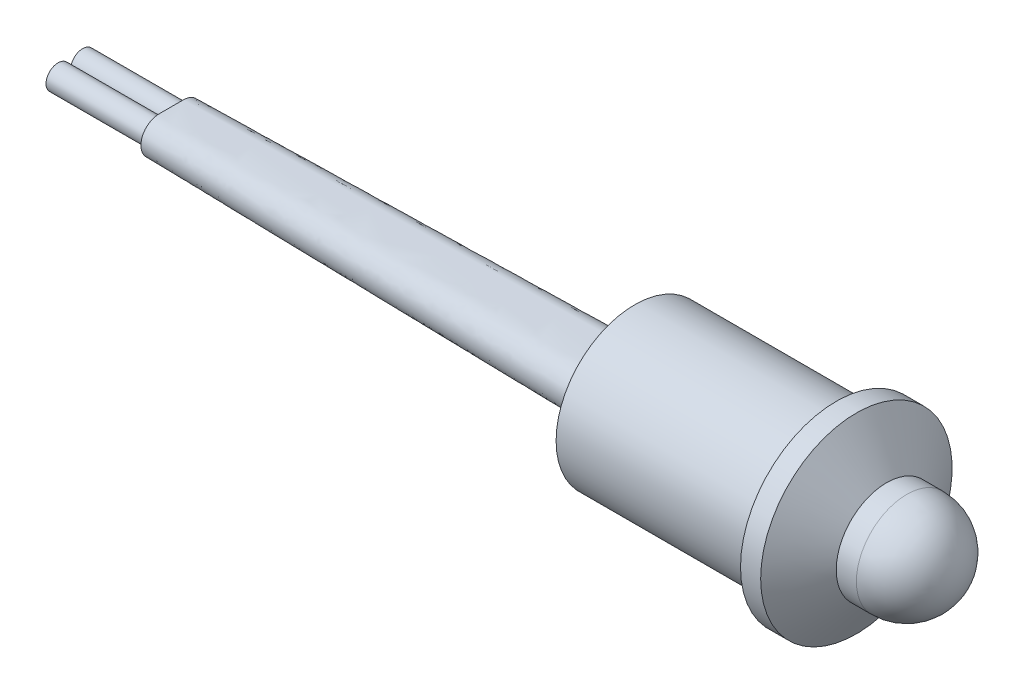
ISO-10303-21;
HEADER;
FILE_DESCRIPTION(('STEP AP214'),'2;1');
FILE_NAME('part.step','',(''),(''),'','','');
FILE_SCHEMA(('AUTOMOTIVE_DESIGN { 1 0 10303 214 1 1 1 1 }'));
ENDSEC;
DATA;
#1=APPLICATION_CONTEXT('core data for automotive mechanical design processes');
#2=APPLICATION_PROTOCOL_DEFINITION('international standard','automotive_design',2000,#1);
#3=PRODUCT_CONTEXT('',#1,'mechanical');
#4=PRODUCT('Part','Part','',(#3));
#5=PRODUCT_RELATED_PRODUCT_CATEGORY('part','',(#4));
#6=PRODUCT_DEFINITION_FORMATION('','',#4);
#7=PRODUCT_DEFINITION_CONTEXT('part definition',#1,'design');
#8=PRODUCT_DEFINITION('design','',#6,#7);
#9=PRODUCT_DEFINITION_SHAPE('','',#8);
#10=(LENGTH_UNIT() NAMED_UNIT(*) SI_UNIT(.MILLI.,.METRE.));
#11=(NAMED_UNIT(*) PLANE_ANGLE_UNIT() SI_UNIT($,.RADIAN.));
#12=(NAMED_UNIT(*) SI_UNIT($,.STERADIAN.) SOLID_ANGLE_UNIT());
#13=UNCERTAINTY_MEASURE_WITH_UNIT(LENGTH_MEASURE(1.E-05),#10,'distance_accuracy_value','');
#14=(GEOMETRIC_REPRESENTATION_CONTEXT(3) GLOBAL_UNCERTAINTY_ASSIGNED_CONTEXT((#13)) GLOBAL_UNIT_ASSIGNED_CONTEXT((#10,
#11,#12)) REPRESENTATION_CONTEXT('',''));
#15=CARTESIAN_POINT('',(0.,0.,0.));
#16=DIRECTION('',(0.,0.,1.));
#17=DIRECTION('',(1.,0.,0.));
#18=AXIS2_PLACEMENT_3D('',#15,#16,#17);
#19=CARTESIAN_POINT('',(0.,0.,0.));
#20=DIRECTION('',(-1.,0.,0.));
#21=DIRECTION('',(0.,0.,1.));
#22=AXIS2_PLACEMENT_3D('',#19,#20,#21);
#23=CYLINDRICAL_SURFACE('',#22,2.5);
#24=CARTESIAN_POINT('',(5.5,0.,0.));
#25=DIRECTION('',(-1.,0.,0.));
#26=DIRECTION('',(0.,0.,1.));
#27=AXIS2_PLACEMENT_3D('',#24,#25,#26);
#28=CIRCLE('',#27,2.5);
#29=CARTESIAN_POINT('',(5.5,0.,2.5));
#30=VERTEX_POINT('',#29);
#31=EDGE_CURVE('E169',#30,#30,#28,.T.);
#32=ORIENTED_EDGE('',*,*,#31,.F.);
#33=EDGE_LOOP('',(#32));
#34=FACE_BOUND('',#33,.T.);
#35=CARTESIAN_POINT('',(1.,0.,0.));
#36=DIRECTION('',(-1.,0.,0.));
#37=DIRECTION('',(0.,0.,1.));
#38=AXIS2_PLACEMENT_3D('',#35,#36,#37);
#39=CIRCLE('',#38,2.5);
#40=CARTESIAN_POINT('',(1.,0.,2.5));
#41=VERTEX_POINT('',#40);
#42=EDGE_CURVE('E12',#41,#41,#39,.T.);
#43=ORIENTED_EDGE('',*,*,#42,.T.);
#44=EDGE_LOOP('',(#43));
#45=FACE_BOUND('',#44,.T.);
#46=ADVANCED_FACE('F141',(#34,#45),#23,.F.);
#47=CARTESIAN_POINT('',(1.,2.5,0.));
#48=DIRECTION('',(1.,0.,0.));
#49=DIRECTION('',(0.,0.,-1.));
#50=AXIS2_PLACEMENT_3D('',#47,#48,#49);
#51=PLANE('',#50);
#52=ORIENTED_EDGE('',*,*,#42,.F.);
#53=EDGE_LOOP('',(#52));
#54=FACE_BOUND('',#53,.T.);
#55=CARTESIAN_POINT('',(1.,0.,0.));
#56=DIRECTION('',(-1.,0.,0.));
#57=DIRECTION('',(0.,0.,1.));
#58=AXIS2_PLACEMENT_3D('',#55,#56,#57);
#59=CIRCLE('',#58,3.25);
#60=CARTESIAN_POINT('',(1.,0.,3.25));
#61=VERTEX_POINT('',#60);
#62=EDGE_CURVE('E147',#61,#61,#59,.T.);
#63=ORIENTED_EDGE('',*,*,#62,.T.);
#64=EDGE_LOOP('',(#63));
#65=FACE_BOUND('',#64,.T.);
#66=ADVANCED_FACE('F176',(#54,#65),#51,.F.);
#67=CARTESIAN_POINT('',(0.,0.,0.));
#68=DIRECTION('',(-1.,0.,0.));
#69=DIRECTION('',(0.,0.,1.));
#70=AXIS2_PLACEMENT_3D('',#67,#68,#69);
#71=CYLINDRICAL_SURFACE('',#70,3.25);
#72=ORIENTED_EDGE('',*,*,#62,.F.);
#73=EDGE_LOOP('',(#72));
#74=FACE_BOUND('',#73,.T.);
#75=CARTESIAN_POINT('',(-7.,0.,0.));
#76=DIRECTION('',(-1.,0.,0.));
#77=DIRECTION('',(0.,0.,1.));
#78=AXIS2_PLACEMENT_3D('',#75,#76,#77);
#79=CIRCLE('',#78,3.25);
#80=CARTESIAN_POINT('',(-7.,0.,3.25));
#81=VERTEX_POINT('',#80);
#82=EDGE_CURVE('E151',#81,#81,#79,.T.);
#83=ORIENTED_EDGE('',*,*,#82,.T.);
#84=EDGE_LOOP('',(#83));
#85=FACE_BOUND('',#84,.T.);
#86=ADVANCED_FACE('F180',(#74,#85),#71,.F.);
#87=CARTESIAN_POINT('',(-7.,3.25,0.));
#88=DIRECTION('',(1.,0.,0.));
#89=DIRECTION('',(0.,0.,-1.));
#90=AXIS2_PLACEMENT_3D('',#87,#88,#89);
#91=PLANE('',#90);
#92=ORIENTED_EDGE('',*,*,#82,.F.);
#93=EDGE_LOOP('',(#92));
#94=FACE_BOUND('',#93,.T.);
#95=CARTESIAN_POINT('',(-7.,0.,0.));
#96=DIRECTION('',(-1.,0.,0.));
#97=DIRECTION('',(0.,0.,1.));
#98=AXIS2_PLACEMENT_3D('',#95,#96,#97);
#99=CIRCLE('',#98,3.9);
#100=CARTESIAN_POINT('',(-7.,0.,3.9));
#101=VERTEX_POINT('',#100);
#102=EDGE_CURVE('E155',#101,#101,#99,.T.);
#103=ORIENTED_EDGE('',*,*,#102,.T.);
#104=EDGE_LOOP('',(#103));
#105=FACE_BOUND('',#104,.T.);
#106=ADVANCED_FACE('F185',(#94,#105),#91,.F.);
#107=CARTESIAN_POINT('',(0.,0.,0.));
#108=DIRECTION('',(-1.,0.,0.));
#109=DIRECTION('',(0.,0.,1.));
#110=AXIS2_PLACEMENT_3D('',#107,#108,#109);
#111=CYLINDRICAL_SURFACE('',#110,3.9);
#112=ORIENTED_EDGE('',*,*,#102,.F.);
#113=EDGE_LOOP('',(#112));
#114=FACE_BOUND('',#113,.T.);
#115=CARTESIAN_POINT('',(3.,0.,0.));
#116=DIRECTION('',(-1.,0.,0.));
#117=DIRECTION('',(0.,0.,1.));
#118=AXIS2_PLACEMENT_3D('',#115,#116,#117);
#119=CIRCLE('',#118,3.9);
#120=CARTESIAN_POINT('',(3.,0.,3.9));
#121=VERTEX_POINT('',#120);
#122=EDGE_CURVE('E160',#121,#121,#119,.T.);
#123=ORIENTED_EDGE('',*,*,#122,.T.);
#124=EDGE_LOOP('',(#123));
#125=FACE_BOUND('',#124,.T.);
#126=ADVANCED_FACE('F191',(#114,#125),#111,.T.);
#127=CARTESIAN_POINT('',(3.,3.9,0.));
#128=DIRECTION('',(1.,0.,0.));
#129=DIRECTION('',(0.,0.,-1.));
#130=AXIS2_PLACEMENT_3D('',#127,#128,#129);
#131=PLANE('',#130);
#132=ORIENTED_EDGE('',*,*,#122,.F.);
#133=EDGE_LOOP('',(#132));
#134=FACE_BOUND('',#133,.T.);
#135=CARTESIAN_POINT('',(3.,0.,0.));
#136=DIRECTION('',(-1.,0.,0.));
#137=DIRECTION('',(0.,0.,1.));
#138=AXIS2_PLACEMENT_3D('',#135,#136,#137);
#139=CIRCLE('',#138,4.75);
#140=CARTESIAN_POINT('',(3.,0.,4.75));
#141=VERTEX_POINT('',#140);
#142=EDGE_CURVE('E163',#141,#141,#139,.T.);
#143=ORIENTED_EDGE('',*,*,#142,.T.);
#144=EDGE_LOOP('',(#143));
#145=FACE_BOUND('',#144,.T.);
#146=ADVANCED_FACE('F195',(#134,#145),#131,.F.);
#147=CARTESIAN_POINT('',(0.,0.,0.));
#148=DIRECTION('',(-1.,0.,0.));
#149=DIRECTION('',(0.,0.,1.));
#150=AXIS2_PLACEMENT_3D('',#147,#148,#149);
#151=CYLINDRICAL_SURFACE('',#150,4.75);
#152=ORIENTED_EDGE('',*,*,#142,.F.);
#153=EDGE_LOOP('',(#152));
#154=FACE_BOUND('',#153,.T.);
#155=CARTESIAN_POINT('',(4.,0.,0.));
#156=DIRECTION('',(-1.,0.,0.));
#157=DIRECTION('',(0.,0.,1.));
#158=AXIS2_PLACEMENT_3D('',#155,#156,#157);
#159=CIRCLE('',#158,4.75);
#160=CARTESIAN_POINT('',(4.,0.,4.75));
#161=VERTEX_POINT('',#160);
#162=EDGE_CURVE('E166',#161,#161,#159,.T.);
#163=ORIENTED_EDGE('',*,*,#162,.T.);
#164=EDGE_LOOP('',(#163));
#165=FACE_BOUND('',#164,.T.);
#166=ADVANCED_FACE('F199',(#154,#165),#151,.T.);
#167=CARTESIAN_POINT('',(5.5,0.,0.));
#168=DIRECTION('',(-1.,0.,0.));
#169=DIRECTION('',(0.,0.,1.));
#170=AXIS2_PLACEMENT_3D('',#167,#168,#169);
#171=CONICAL_SURFACE('',#170,2.5,0.982793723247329);
#172=ORIENTED_EDGE('',*,*,#162,.F.);
#173=EDGE_LOOP('',(#172));
#174=FACE_BOUND('',#173,.T.);
#175=ORIENTED_EDGE('',*,*,#31,.T.);
#176=EDGE_LOOP('',(#175));
#177=FACE_BOUND('',#176,.T.);
#178=ADVANCED_FACE('F173',(#174,#177),#171,.T.);
#179=CLOSED_SHELL('',(#46,#66,#86,#106,#126,#146,#166,#178));
#180=MANIFOLD_SOLID_BREP('B2',#179);
#181=CARTESIAN_POINT('',(0.,0.,0.));
#182=DIRECTION('',(1.,0.,0.));
#183=DIRECTION('',(0.,0.,-1.));
#184=AXIS2_PLACEMENT_3D('',#181,#182,#183);
#185=PLANE('',#184);
#186=DIRECTION('',(0.,0.,1.));
#187=VECTOR('',#186,1.);
#188=CARTESIAN_POINT('',(0.,-1.15,-0.95));
#189=LINE('',#188,#187);
#190=CARTESIAN_POINT('',(0.,-1.15,-0.95));
#191=VERTEX_POINT('',#190);
#192=CARTESIAN_POINT('',(0.,-1.15,0.95));
#193=VERTEX_POINT('',#192);
#194=EDGE_CURVE('E304',#191,#193,#189,.T.);
#195=ORIENTED_EDGE('',*,*,#194,.F.);
#196=CARTESIAN_POINT('',(0.,1.15,-0.95));
#197=CARTESIAN_POINT('',(0.,1.15003229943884,-1.01491963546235));
#198=CARTESIAN_POINT('',(0.,1.14431435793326,-1.07976877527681));
#199=CARTESIAN_POINT('',(0.,1.12205376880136,-1.20763184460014));
#200=CARTESIAN_POINT('',(0.,1.10550480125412,-1.27064468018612));
#201=CARTESIAN_POINT('',(0.,1.0622832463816,-1.39299379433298));
#202=CARTESIAN_POINT('',(0.,1.03562180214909,-1.45233403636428));
#203=CARTESIAN_POINT('',(0.,0.97288637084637,-1.56581500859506));
#204=CARTESIAN_POINT('',(0.,0.936818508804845,-1.6199590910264));
#205=CARTESIAN_POINT('',(0.,0.87596447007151,-1.69635174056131));
#206=CARTESIAN_POINT('',(0.,0.854359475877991,-1.72118564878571));
#207=CARTESIAN_POINT('',(0.,0.809023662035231,-1.76882985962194));
#208=CARTESIAN_POINT('',(0.,0.785292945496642,-1.79164026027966));
#209=CARTESIAN_POINT('',(0.,0.711197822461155,-1.85677311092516));
#210=CARTESIAN_POINT('',(0.,0.657903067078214,-1.89583153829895));
#211=CARTESIAN_POINT('',(0.,0.547760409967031,-1.96296277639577));
#212=CARTESIAN_POINT('',(0.,0.491137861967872,-1.99141045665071));
#213=CARTESIAN_POINT('',(0.,0.374068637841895,-2.03888417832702));
#214=CARTESIAN_POINT('',(0.,0.313621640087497,-2.05790942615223));
#215=CARTESIAN_POINT('',(0.,0.187703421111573,-2.08654577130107));
#216=CARTESIAN_POINT('',(0.,0.122128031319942,-2.09571114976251));
#217=CARTESIAN_POINT('',(0.,0.0233971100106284,-2.10070868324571));
#218=CARTESIAN_POINT('',(0.,-0.00958264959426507,-2.10091508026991));
#219=CARTESIAN_POINT('',(0.,-0.0754306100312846,-2.09839947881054));
#220=CARTESIAN_POINT('',(0.,-0.108298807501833,-2.09567739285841));
#221=CARTESIAN_POINT('',(0.,-0.204013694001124,-2.08356068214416));
#222=CARTESIAN_POINT('',(0.,-0.266410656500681,-2.07032003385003));
#223=CARTESIAN_POINT('',(0.,-0.388255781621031,-2.03392902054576));
#224=CARTESIAN_POINT('',(0.,-0.447701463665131,-2.01077047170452));
#225=CARTESIAN_POINT('',(0.,-0.563981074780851,-1.95422325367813));
#226=CARTESIAN_POINT('',(0.,-0.620663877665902,-1.92052194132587));
#227=CARTESIAN_POINT('',(0.,-0.727336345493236,-1.84388157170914));
#228=CARTESIAN_POINT('',(0.,-0.777333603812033,-1.80095314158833));
#229=CARTESIAN_POINT('',(0.,-0.867683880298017,-1.70813883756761));
#230=CARTESIAN_POINT('',(0.,-0.908255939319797,-1.65846561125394));
#231=CARTESIAN_POINT('',(0.,-0.980725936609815,-1.55308103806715));
#232=CARTESIAN_POINT('',(0.,-1.01261191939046,-1.49736151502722));
#233=CARTESIAN_POINT('',(0.,-1.067275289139,-1.38079207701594));
#234=CARTESIAN_POINT('',(0.,-1.08993706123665,-1.31988796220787));
#235=CARTESIAN_POINT('',(0.,-1.12482470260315,-1.19527456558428));
#236=CARTESIAN_POINT('',(0.,-1.13707416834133,-1.13157197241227));
#237=CARTESIAN_POINT('',(0.,-1.14793349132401,-1.0283492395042));
#238=CARTESIAN_POINT('',(0.,-1.1500128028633,-0.989170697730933));
#239=CARTESIAN_POINT('',(0.,-1.15,-0.950000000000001));
#240=B_SPLINE_CURVE_WITH_KNOTS('',3,(#196,#197,#198,#199,#200,#201,#202,#203,#204,#205,#206,
#207,#208,#209,#210,#211,#212,#213,#214,#215,#216,#217,#218,#219,#220,#221,#222,#223,#224,#225,
#226,#227,#228,#229,#230,#231,#232,#233,#234,#235,#236,#237,#238,#239),.UNSPECIFIED.,.F.,.F.,(4,
2,2,2,2,2,2,2,2,2,2,2,2,2,2,2,2,2,2,2,2,4),(0.,0.194409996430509,0.388933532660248,
0.58324334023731,0.777426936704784,0.876063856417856,0.974695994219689,1.17183043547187,
1.36113113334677,1.55044777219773,1.74800315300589,1.84682940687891,1.94565861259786,
2.13608714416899,2.32667311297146,2.52355430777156,2.72020995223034,2.91169411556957,
3.10344052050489,3.29752126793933,3.49116100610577,3.60865173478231),.UNSPECIFIED.);
#241=CARTESIAN_POINT('',(0.,1.15,-0.95));
#242=VERTEX_POINT('',#241);
#243=EDGE_CURVE('E280',#242,#191,#240,.T.);
#244=ORIENTED_EDGE('',*,*,#243,.F.);
#245=DIRECTION('',(0.,0.,-1.));
#246=VECTOR('',#245,1.);
#247=CARTESIAN_POINT('',(0.,1.15,-0.95));
#248=LINE('',#247,#246);
#249=CARTESIAN_POINT('',(0.,1.15,0.950000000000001));
#250=VERTEX_POINT('',#249);
#251=EDGE_CURVE('E299',#250,#242,#248,.T.);
#252=ORIENTED_EDGE('',*,*,#251,.F.);
#253=CARTESIAN_POINT('',(0.,-1.15,0.950000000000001));
#254=CARTESIAN_POINT('',(0.,-1.15003229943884,1.01491963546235));
#255=CARTESIAN_POINT('',(0.,-1.14431435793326,1.07976877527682));
#256=CARTESIAN_POINT('',(0.,-1.12205376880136,1.20763184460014));
#257=CARTESIAN_POINT('',(0.,-1.10550480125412,1.27064468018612));
#258=CARTESIAN_POINT('',(0.,-1.0622832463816,1.39299379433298));
#259=CARTESIAN_POINT('',(0.,-1.03562180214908,1.45233403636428));
#260=CARTESIAN_POINT('',(0.,-0.972886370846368,1.56581500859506));
#261=CARTESIAN_POINT('',(0.,-0.936818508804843,1.6199590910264));
#262=CARTESIAN_POINT('',(0.,-0.875964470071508,1.69635174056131));
#263=CARTESIAN_POINT('',(0.,-0.85435947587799,1.72118564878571));
#264=CARTESIAN_POINT('',(0.,-0.809023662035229,1.76882985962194));
#265=CARTESIAN_POINT('',(0.,-0.785292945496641,1.79164026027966));
#266=CARTESIAN_POINT('',(0.,-0.711197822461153,1.85677311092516));
#267=CARTESIAN_POINT('',(0.,-0.657903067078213,1.89583153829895));
#268=CARTESIAN_POINT('',(0.,-0.54776040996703,1.96296277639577));
#269=CARTESIAN_POINT('',(0.,-0.491137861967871,1.99141045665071));
#270=CARTESIAN_POINT('',(0.,-0.374068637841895,2.03888417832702));
#271=CARTESIAN_POINT('',(0.,-0.313621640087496,2.05790942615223));
#272=CARTESIAN_POINT('',(0.,-0.187703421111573,2.08654577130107));
#273=CARTESIAN_POINT('',(0.,-0.122128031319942,2.09571114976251));
#274=CARTESIAN_POINT('',(0.,-0.0233971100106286,2.10070868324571));
#275=CARTESIAN_POINT('',(0.,0.00958264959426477,2.10091508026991));
#276=CARTESIAN_POINT('',(0.,0.0754306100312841,2.09839947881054));
#277=CARTESIAN_POINT('',(0.,0.108298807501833,2.09567739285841));
#278=CARTESIAN_POINT('',(0.,0.204013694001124,2.08356068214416));
#279=CARTESIAN_POINT('',(0.,0.266410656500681,2.07032003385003));
#280=CARTESIAN_POINT('',(0.,0.388255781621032,2.03392902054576));
#281=CARTESIAN_POINT('',(0.,0.447701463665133,2.01077047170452));
#282=CARTESIAN_POINT('',(0.,0.563981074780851,1.95422325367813));
#283=CARTESIAN_POINT('',(0.,0.620663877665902,1.92052194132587));
#284=CARTESIAN_POINT('',(0.,0.727336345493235,1.84388157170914));
#285=CARTESIAN_POINT('',(0.,0.777333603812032,1.80095314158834));
#286=CARTESIAN_POINT('',(0.,0.867683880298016,1.70813883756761));
#287=CARTESIAN_POINT('',(0.,0.908255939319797,1.65846561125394));
#288=CARTESIAN_POINT('',(0.,0.980725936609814,1.55308103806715));
#289=CARTESIAN_POINT('',(0.,1.01261191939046,1.49736151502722));
#290=CARTESIAN_POINT('',(0.,1.067275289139,1.38079207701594));
#291=CARTESIAN_POINT('',(0.,1.08993706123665,1.31988796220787));
#292=CARTESIAN_POINT('',(0.,1.12482470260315,1.19527456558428));
#293=CARTESIAN_POINT('',(0.,1.13707416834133,1.13157197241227));
#294=CARTESIAN_POINT('',(0.,1.14793349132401,1.0283492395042));
#295=CARTESIAN_POINT('',(0.,1.1500128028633,0.989170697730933));
#296=CARTESIAN_POINT('',(0.,1.15,0.950000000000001));
#297=B_SPLINE_CURVE_WITH_KNOTS('',3,(#253,#254,#255,#256,#257,#258,#259,#260,#261,#262,#263,
#264,#265,#266,#267,#268,#269,#270,#271,#272,#273,#274,#275,#276,#277,#278,#279,#280,#281,#282,
#283,#284,#285,#286,#287,#288,#289,#290,#291,#292,#293,#294,#295,#296),.UNSPECIFIED.,.F.,.F.,(4,
2,2,2,2,2,2,2,2,2,2,2,2,2,2,2,2,2,2,2,2,4),(0.,0.194409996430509,0.388933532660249,
0.583243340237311,0.777426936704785,0.876063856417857,0.97469599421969,1.17183043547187,
1.36113113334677,1.55044777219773,1.74800315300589,1.84682940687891,1.94565861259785,
2.13608714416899,2.32667311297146,2.52355430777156,2.72020995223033,2.91169411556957,
3.10344052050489,3.29752126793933,3.49116100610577,3.60865173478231),.UNSPECIFIED.);
#298=EDGE_CURVE('E301',#193,#250,#297,.T.);
#299=ORIENTED_EDGE('',*,*,#298,.F.);
#300=EDGE_LOOP('',(#195,#244,#252,#299));
#301=FACE_BOUND('',#300,.T.);
#302=CARTESIAN_POINT('',(0.,0.,0.));
#303=DIRECTION('',(-1.,0.,0.));
#304=DIRECTION('',(0.,0.,1.));
#305=AXIS2_PLACEMENT_3D('',#302,#303,#304);
#306=CIRCLE('',#305,2.75);
#307=CARTESIAN_POINT('',(0.,0.,2.75));
#308=VERTEX_POINT('',#307);
#309=EDGE_CURVE('E139',#308,#308,#306,.T.);
#310=ORIENTED_EDGE('',*,*,#309,.T.);
#311=EDGE_LOOP('',(#310));
#312=FACE_BOUND('',#311,.T.);
#313=ADVANCED_FACE('F262',(#301,#312),#185,.F.);
#314=CARTESIAN_POINT('',(0.,0.,0.));
#315=DIRECTION('',(-1.,0.,0.));
#316=DIRECTION('',(0.,0.,1.));
#317=AXIS2_PLACEMENT_3D('',#314,#315,#316);
#318=CYLINDRICAL_SURFACE('',#317,2.75);
#319=ORIENTED_EDGE('',*,*,#309,.F.);
#320=EDGE_LOOP('',(#319));
#321=FACE_BOUND('',#320,.T.);
#322=CARTESIAN_POINT('',(1.,0.,0.));
#323=DIRECTION('',(-1.,0.,0.));
#324=DIRECTION('',(0.,0.,1.));
#325=AXIS2_PLACEMENT_3D('',#322,#323,#324);
#326=CIRCLE('',#325,2.75);
#327=CARTESIAN_POINT('',(1.,0.,2.75));
#328=VERTEX_POINT('',#327);
#329=EDGE_CURVE('E272',#328,#328,#326,.T.);
#330=ORIENTED_EDGE('',*,*,#329,.T.);
#331=EDGE_LOOP('',(#330));
#332=FACE_BOUND('',#331,.T.);
#333=ADVANCED_FACE('F443',(#321,#332),#318,.T.);
#334=CARTESIAN_POINT('',(1.,2.75,0.));
#335=DIRECTION('',(-1.,0.,0.));
#336=DIRECTION('',(0.,0.,1.));
#337=AXIS2_PLACEMENT_3D('',#334,#335,#336);
#338=PLANE('',#337);
#339=ORIENTED_EDGE('',*,*,#329,.F.);
#340=EDGE_LOOP('',(#339));
#341=FACE_BOUND('',#340,.T.);
#342=CARTESIAN_POINT('',(1.,0.,0.));
#343=DIRECTION('',(-1.,0.,0.));
#344=DIRECTION('',(0.,0.,1.));
#345=AXIS2_PLACEMENT_3D('',#342,#343,#344);
#346=CIRCLE('',#345,2.5);
#347=CARTESIAN_POINT('',(1.,0.,2.5));
#348=VERTEX_POINT('',#347);
#349=EDGE_CURVE('E405',#348,#348,#346,.T.);
#350=ORIENTED_EDGE('',*,*,#349,.T.);
#351=EDGE_LOOP('',(#350));
#352=FACE_BOUND('',#351,.T.);
#353=ADVANCED_FACE('F447',(#341,#352),#338,.F.);
#354=CARTESIAN_POINT('',(0.,0.,0.));
#355=DIRECTION('',(-1.,0.,0.));
#356=DIRECTION('',(0.,0.,1.));
#357=AXIS2_PLACEMENT_3D('',#354,#355,#356);
#358=CYLINDRICAL_SURFACE('',#357,2.5);
#359=ORIENTED_EDGE('',*,*,#349,.F.);
#360=EDGE_LOOP('',(#359));
#361=FACE_BOUND('',#360,.T.);
#362=CARTESIAN_POINT('',(6.5,0.,0.));
#363=DIRECTION('',(-1.,0.,0.));
#364=DIRECTION('',(0.,0.,1.));
#365=AXIS2_PLACEMENT_3D('',#362,#363,#364);
#366=CIRCLE('',#365,2.5);
#367=CARTESIAN_POINT('',(6.5,0.,2.5));
#368=VERTEX_POINT('',#367);
#369=EDGE_CURVE('E397',#368,#368,#366,.T.);
#370=ORIENTED_EDGE('',*,*,#369,.T.);
#371=EDGE_LOOP('',(#370));
#372=FACE_BOUND('',#371,.T.);
#373=ADVANCED_FACE('F438',(#361,#372),#358,.T.);
#374=CARTESIAN_POINT('',(6.5,0.,0.));
#375=DIRECTION('',(-1.,0.,0.));
#376=DIRECTION('',(0.,1.,0.));
#377=AXIS2_PLACEMENT_3D('',#374,#375,#376);
#378=SPHERICAL_SURFACE('',#377,2.5);
#379=ORIENTED_EDGE('',*,*,#369,.F.);
#380=EDGE_LOOP('',(#379));
#381=FACE_BOUND('',#380,.T.);
#382=ADVANCED_FACE('F433',(#381),#378,.T.);
#383=CARTESIAN_POINT('',(-30.,0.,-0.6));
#384=DIRECTION('',(-1.,0.,0.));
#385=DIRECTION('',(0.,0.,1.));
#386=AXIS2_PLACEMENT_3D('',#383,#384,#385);
#387=PLANE('',#386);
#388=CARTESIAN_POINT('',(-30.,0.,0.61));
#389=DIRECTION('',(-1.,0.,0.));
#390=DIRECTION('',(0.,0.,1.));
#391=AXIS2_PLACEMENT_3D('',#388,#389,#390);
#392=CIRCLE('',#391,0.6);
#393=CARTESIAN_POINT('',(-30.,0.,1.21));
#394=VERTEX_POINT('',#393);
#395=EDGE_CURVE('E419',#394,#394,#392,.T.);
#396=ORIENTED_EDGE('',*,*,#395,.F.);
#397=EDGE_LOOP('',(#396));
#398=FACE_BOUND('',#397,.T.);
#399=CARTESIAN_POINT('',(-30.,0.,-0.61));
#400=DIRECTION('',(-1.,0.,0.));
#401=DIRECTION('',(0.,0.,1.));
#402=AXIS2_PLACEMENT_3D('',#399,#400,#401);
#403=CIRCLE('',#402,0.6);
#404=CARTESIAN_POINT('',(-30.,0.,-0.01));
#405=VERTEX_POINT('',#404);
#406=EDGE_CURVE('E411',#405,#405,#403,.T.);
#407=ORIENTED_EDGE('',*,*,#406,.F.);
#408=EDGE_LOOP('',(#407));
#409=FACE_BOUND('',#408,.T.);
#410=CARTESIAN_POINT('',(-30.,0.,-0.6));
#411=DIRECTION('',(-1.,0.,0.));
#412=DIRECTION('',(0.,0.,1.));
#413=AXIS2_PLACEMENT_3D('',#410,#411,#412);
#414=CIRCLE('',#413,0.9);
#415=CARTESIAN_POINT('',(-30.,0.9,-0.6));
#416=VERTEX_POINT('',#415);
#417=CARTESIAN_POINT('',(-30.,-0.9,-0.600000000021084));
#418=VERTEX_POINT('',#417);
#419=EDGE_CURVE('E308',#416,#418,#414,.T.);
#420=ORIENTED_EDGE('',*,*,#419,.T.);
#421=DIRECTION('',(0.,0.,1.));
#422=VECTOR('',#421,1.);
#423=CARTESIAN_POINT('',(-30.,-0.9,-0.6));
#424=LINE('',#423,#422);
#425=CARTESIAN_POINT('',(-30.,-0.9,0.600000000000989));
#426=VERTEX_POINT('',#425);
#427=EDGE_CURVE('E311',#418,#426,#424,.T.);
#428=ORIENTED_EDGE('',*,*,#427,.T.);
#429=CARTESIAN_POINT('',(-30.,0.,0.6));
#430=DIRECTION('',(-1.,0.,0.));
#431=DIRECTION('',(0.,0.,1.));
#432=AXIS2_PLACEMENT_3D('',#429,#430,#431);
#433=CIRCLE('',#432,0.9);
#434=CARTESIAN_POINT('',(-30.,0.9,0.6));
#435=VERTEX_POINT('',#434);
#436=EDGE_CURVE('E375',#426,#435,#433,.T.);
#437=ORIENTED_EDGE('',*,*,#436,.T.);
#438=DIRECTION('',(0.,0.,-1.));
#439=VECTOR('',#438,1.);
#440=CARTESIAN_POINT('',(-30.,0.9,-0.6));
#441=LINE('',#440,#439);
#442=EDGE_CURVE('E379',#435,#416,#441,.T.);
#443=ORIENTED_EDGE('',*,*,#442,.T.);
#444=EDGE_LOOP('',(#420,#428,#437,#443));
#445=FACE_BOUND('',#444,.T.);
#446=ADVANCED_FACE('F334',(#398,#409,#445),#387,.T.);
#447=CARTESIAN_POINT('',(0.,1.15,0.949999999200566));
#448=CARTESIAN_POINT('',(-30.,0.9,0.599999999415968));
#449=CARTESIAN_POINT('',(0.,1.15,0.802392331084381));
#450=CARTESIAN_POINT('',(-30.,0.9,0.492164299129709));
#451=CARTESIAN_POINT('',(0.,1.15,0.492823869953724));
#452=CARTESIAN_POINT('',(-30.,0.9,0.28950661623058));
#453=CARTESIAN_POINT('',(0.,1.15,0.));
#454=CARTESIAN_POINT('',(-30.,0.899999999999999,0.));
#455=CARTESIAN_POINT('',(0.,1.15,-0.492823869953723));
#456=CARTESIAN_POINT('',(-30.,0.9,-0.28950661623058));
#457=CARTESIAN_POINT('',(0.,1.15,-0.802392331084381));
#458=CARTESIAN_POINT('',(-30.,0.9,-0.492164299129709));
#459=CARTESIAN_POINT('',(0.,1.15,-1.26179495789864));
#460=CARTESIAN_POINT('',(-30.,0.9,-0.827783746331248));
#461=CARTESIAN_POINT('',(0.,0.887695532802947,-1.86246528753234));
#462=CARTESIAN_POINT('',(-30.0000000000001,0.717411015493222,-1.29580116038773));
#463=CARTESIAN_POINT('',(0.,0.,-2.21947701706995));
#464=CARTESIAN_POINT('',(-29.9999999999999,0.,-1.60350301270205));
#465=CARTESIAN_POINT('',(0.,-0.887695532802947,-1.86246528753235));
#466=CARTESIAN_POINT('',(-30.,-0.717411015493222,-1.29580116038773));
#467=CARTESIAN_POINT('',(0.,-1.15,-1.26179495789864));
#468=CARTESIAN_POINT('',(-30.,-0.9,-0.827783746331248));
#469=CARTESIAN_POINT('',(0.,-1.15,-0.802392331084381));
#470=CARTESIAN_POINT('',(-30.,-0.9,-0.492164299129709));
#471=CARTESIAN_POINT('',(0.,-1.15,-0.492823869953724));
#472=CARTESIAN_POINT('',(-30.,-0.900000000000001,-0.289506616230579));
#473=CARTESIAN_POINT('',(0.,-1.15,0.));
#474=CARTESIAN_POINT('',(-30.,-0.899999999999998,0.));
#475=CARTESIAN_POINT('',(0.,-1.15,0.492823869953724));
#476=CARTESIAN_POINT('',(-30.,-0.900000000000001,0.28950661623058));
#477=CARTESIAN_POINT('',(0.,-1.15,0.80239233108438));
#478=CARTESIAN_POINT('',(-30.,-0.9,0.492164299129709));
#479=CARTESIAN_POINT('',(0.,-1.15,1.26179495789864));
#480=CARTESIAN_POINT('',(-30.,-0.9,0.827783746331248));
#481=CARTESIAN_POINT('',(0.,-0.887695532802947,1.86246528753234));
#482=CARTESIAN_POINT('',(-30.,-0.717411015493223,1.29580116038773));
#483=CARTESIAN_POINT('',(0.,0.,2.21947701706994));
#484=CARTESIAN_POINT('',(-30.,0.,1.60350301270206));
#485=CARTESIAN_POINT('',(0.,0.887695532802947,1.86246528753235));
#486=CARTESIAN_POINT('',(-30.,0.717411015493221,1.29580116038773));
#487=CARTESIAN_POINT('',(0.,1.15,1.26179495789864));
#488=CARTESIAN_POINT('',(-30.,0.9,0.827783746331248));
#489=CARTESIAN_POINT('',(0.,1.15,0.949999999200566));
#490=CARTESIAN_POINT('',(-30.,0.9,0.599999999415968));
#491=B_SPLINE_SURFACE_WITH_KNOTS('',3,1,((#447,#448),(#449,#450),(#451,#452),(#453,#454),(#455,
#456),(#457,#458),(#459,#460),(#461,#462),(#463,#464),(#465,#466),(#467,#468),(#469,#470),(#471,
#472),(#473,#474),(#475,#476),(#477,#478),(#479,#480),(#481,#482),(#483,#484),(#485,#486),(#487,
#488),(#489,#490)),.UNSPECIFIED.,.T.,.F.,.F.,(4,1,1,1,2,1,1,1,2,1,1,1,2,1,1,1,4),(2,2),(0.,
0.0401629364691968,0.0803258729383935,0.12048880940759,0.160651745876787,0.24548880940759,
0.330325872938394,0.415162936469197,0.5,0.540162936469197,0.580325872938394,0.62048880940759,
0.660651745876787,0.74548880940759,0.830325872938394,0.915162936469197,1.),(0.,1.),.UNSPECIFIED.);
#492=CARTESIAN_POINT('',(0.,-1.15,0.));
#493=CARTESIAN_POINT('',(-30.,-0.899999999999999,0.));
#494=CARTESIAN_POINT('',(0.,-1.15,0.164274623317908));
#495=CARTESIAN_POINT('',(-30.,-0.899999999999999,0.096502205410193));
#496=CARTESIAN_POINT('',(0.,-1.15,0.492823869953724));
#497=CARTESIAN_POINT('',(-30.,-0.900000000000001,0.28950661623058));
#498=CARTESIAN_POINT('',(0.,-1.15,0.80239233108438));
#499=CARTESIAN_POINT('',(-30.,-0.9,0.492164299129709));
#500=CARTESIAN_POINT('',(0.,-1.15,1.26179495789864));
#501=CARTESIAN_POINT('',(-30.,-0.9,0.827783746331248));
#502=CARTESIAN_POINT('',(0.,-0.887695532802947,1.86246528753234));
#503=CARTESIAN_POINT('',(-30.,-0.717411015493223,1.29580116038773));
#504=CARTESIAN_POINT('',(0.,0.,2.21947701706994));
#505=CARTESIAN_POINT('',(-30.,0.,1.60350301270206));
#506=CARTESIAN_POINT('',(0.,0.887695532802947,1.86246528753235));
#507=CARTESIAN_POINT('',(-30.,0.717411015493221,1.29580116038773));
#508=CARTESIAN_POINT('',(0.,1.15,1.26179495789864));
#509=CARTESIAN_POINT('',(-30.,0.9,0.827783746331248));
#510=CARTESIAN_POINT('',(0.,1.15,0.802392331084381));
#511=CARTESIAN_POINT('',(-30.,0.9,0.492164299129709));
#512=CARTESIAN_POINT('',(0.,1.15,0.492823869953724));
#513=CARTESIAN_POINT('',(-30.,0.9,0.28950661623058));
#514=CARTESIAN_POINT('',(0.,1.15,0.));
#515=CARTESIAN_POINT('',(-30.,0.899999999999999,0.));
#516=CARTESIAN_POINT('',(0.,1.15,-0.492823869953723));
#517=CARTESIAN_POINT('',(-30.,0.9,-0.28950661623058));
#518=CARTESIAN_POINT('',(0.,1.15,-0.802392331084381));
#519=CARTESIAN_POINT('',(-30.,0.9,-0.492164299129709));
#520=CARTESIAN_POINT('',(0.,1.15,-1.26179495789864));
#521=CARTESIAN_POINT('',(-30.,0.9,-0.827783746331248));
#522=CARTESIAN_POINT('',(0.,0.887695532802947,-1.86246528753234));
#523=CARTESIAN_POINT('',(-30.0000000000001,0.717411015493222,-1.29580116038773));
#524=CARTESIAN_POINT('',(0.,0.,-2.21947701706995));
#525=CARTESIAN_POINT('',(-29.9999999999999,0.,-1.60350301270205));
#526=CARTESIAN_POINT('',(0.,-0.887695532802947,-1.86246528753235));
#527=CARTESIAN_POINT('',(-30.,-0.717411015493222,-1.29580116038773));
#528=CARTESIAN_POINT('',(0.,-1.15,-1.26179495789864));
#529=CARTESIAN_POINT('',(-30.,-0.9,-0.827783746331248));
#530=CARTESIAN_POINT('',(0.,-1.15,-0.802392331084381));
#531=CARTESIAN_POINT('',(-30.,-0.9,-0.492164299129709));
#532=CARTESIAN_POINT('',(0.,-1.15,-0.492823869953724));
#533=CARTESIAN_POINT('',(-30.,-0.900000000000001,-0.289506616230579));
#534=CARTESIAN_POINT('',(0.,-1.15,-0.164274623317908));
#535=CARTESIAN_POINT('',(-30.,-0.899999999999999,-0.0965022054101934));
#536=CARTESIAN_POINT('',(0.,-1.15,0.));
#537=CARTESIAN_POINT('',(-30.,-0.899999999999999,0.));
#538=B_SPLINE_SURFACE_WITH_KNOTS('',3,1,((#492,#493),(#494,#495),(#496,#497),(#498,#499),(#500,
#501),(#502,#503),(#504,#505),(#506,#507),(#508,#509),(#510,#511),(#512,#513),(#514,#515),(#516,
#517),(#518,#519),(#520,#521),(#522,#523),(#524,#525),(#526,#527),(#528,#529),(#530,#531),(#532,
#533),(#534,#535),(#536,#537)),.UNSPECIFIED.,.T.,.F.,.F.,(4,1,2,1,1,1,2,1,1,1,2,1,1,1,2,1,4),(2,
2),(0.580325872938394,0.62048880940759,0.660651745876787,0.74548880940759,0.830325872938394,
0.915162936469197,1.,1.0401629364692,1.08032587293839,1.12048880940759,1.16065174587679,
1.24548880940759,1.33032587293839,1.4151629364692,1.5,1.5401629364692,1.58032587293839),(0.,1.),.UNSPECIFIED.);
#539=ORIENTED_EDGE('',*,*,#251,.T.);
#540=ORIENTED_EDGE('',*,*,#243,.T.);
#541=ORIENTED_EDGE('',*,*,#194,.T.);
#542=ORIENTED_EDGE('',*,*,#298,.T.);
#543=EDGE_LOOP('',(#539,#540,#541,#542));
#544=FACE_BOUND('',#543,.T.);
#545=ORIENTED_EDGE('',*,*,#436,.F.);
#546=ORIENTED_EDGE('',*,*,#427,.F.);
#547=ORIENTED_EDGE('',*,*,#419,.F.);
#548=ORIENTED_EDGE('',*,*,#442,.F.);
#549=EDGE_LOOP('',(#545,#546,#547,#548));
#550=FACE_BOUND('',#549,.T.);
#551=ADVANCED_FACE('F302',(#544,#550),#538,.T.);
#552=CARTESIAN_POINT('',(-35.,0.,-0.61));
#553=DIRECTION('',(1.,0.,0.));
#554=DIRECTION('',(0.,0.,-1.));
#555=AXIS2_PLACEMENT_3D('',#552,#553,#554);
#556=CYLINDRICAL_SURFACE('',#555,0.6);
#557=CARTESIAN_POINT('',(-35.,0.,-0.61));
#558=DIRECTION('',(-1.,0.,0.));
#559=DIRECTION('',(0.,0.,1.));
#560=AXIS2_PLACEMENT_3D('',#557,#558,#559);
#561=CIRCLE('',#560,0.6);
#562=CARTESIAN_POINT('',(-35.,0.,-0.01));
#563=VERTEX_POINT('',#562);
#564=EDGE_CURVE('E409',#563,#563,#561,.T.);
#565=ORIENTED_EDGE('',*,*,#564,.F.);
#566=EDGE_LOOP('',(#565));
#567=FACE_BOUND('',#566,.T.);
#568=ORIENTED_EDGE('',*,*,#406,.T.);
#569=EDGE_LOOP('',(#568));
#570=FACE_BOUND('',#569,.T.);
#571=ADVANCED_FACE('F333',(#567,#570),#556,.T.);
#572=CARTESIAN_POINT('',(-35.,0.,-0.61));
#573=DIRECTION('',(-1.,0.,0.));
#574=DIRECTION('',(0.,0.,1.));
#575=AXIS2_PLACEMENT_3D('',#572,#573,#574);
#576=PLANE('',#575);
#577=ORIENTED_EDGE('',*,*,#564,.T.);
#578=EDGE_LOOP('',(#577));
#579=FACE_BOUND('',#578,.T.);
#580=ADVANCED_FACE('F496',(#579),#576,.T.);
#581=CARTESIAN_POINT('',(-35.,0.,0.61));
#582=DIRECTION('',(1.,0.,0.));
#583=DIRECTION('',(0.,0.,-1.));
#584=AXIS2_PLACEMENT_3D('',#581,#582,#583);
#585=CYLINDRICAL_SURFACE('',#584,0.6);
#586=CARTESIAN_POINT('',(-35.,0.,0.61));
#587=DIRECTION('',(-1.,0.,0.));
#588=DIRECTION('',(0.,0.,1.));
#589=AXIS2_PLACEMENT_3D('',#586,#587,#588);
#590=CIRCLE('',#589,0.6);
#591=CARTESIAN_POINT('',(-35.,0.,1.21));
#592=VERTEX_POINT('',#591);
#593=EDGE_CURVE('E416',#592,#592,#590,.T.);
#594=ORIENTED_EDGE('',*,*,#593,.F.);
#595=EDGE_LOOP('',(#594));
#596=FACE_BOUND('',#595,.T.);
#597=ORIENTED_EDGE('',*,*,#395,.T.);
#598=EDGE_LOOP('',(#597));
#599=FACE_BOUND('',#598,.T.);
#600=ADVANCED_FACE('F506',(#596,#599),#585,.T.);
#601=CARTESIAN_POINT('',(-35.,0.,0.61));
#602=DIRECTION('',(-1.,0.,0.));
#603=DIRECTION('',(0.,0.,1.));
#604=AXIS2_PLACEMENT_3D('',#601,#602,#603);
#605=PLANE('',#604);
#606=ORIENTED_EDGE('',*,*,#593,.T.);
#607=EDGE_LOOP('',(#606));
#608=FACE_BOUND('',#607,.T.);
#609=ADVANCED_FACE('F515',(#608),#605,.T.);
#610=CLOSED_SHELL('',(#313,#333,#353,#373,#382,#446,#551,#571,#580,#600,#609));
#611=MANIFOLD_SOLID_BREP('B7',#610);
#612=ADVANCED_BREP_SHAPE_REPRESENTATION('',(#18,#180,#611),#14);
#613=SHAPE_DEFINITION_REPRESENTATION(#9,#612);
ENDSEC;
END-ISO-10303-21;
